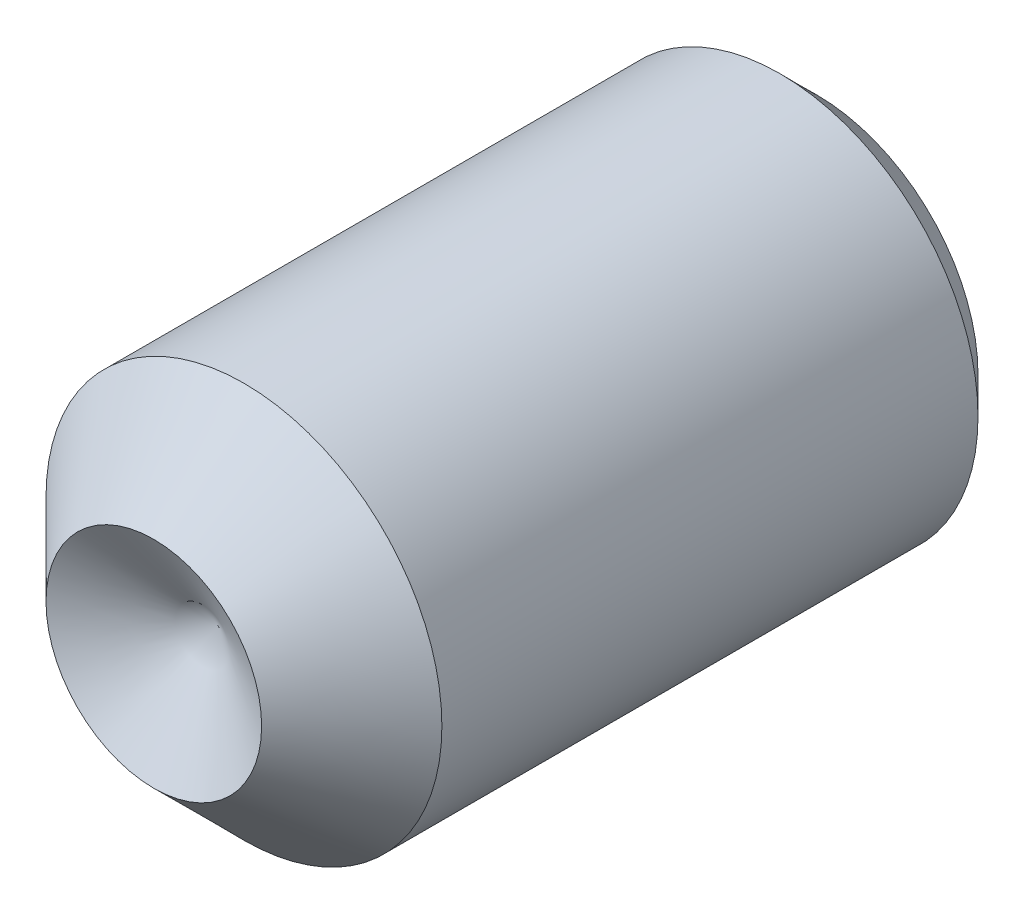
from build123d import *

# Parameters (mm, degrees)
SKETCH1_R     = 1.4224
SHANK_DEPTH   = 4.7625
HEX_2_DEPTH   = 1.27
CHAMFER1_SIZE = 0.262466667


with BuildPart() as part:
    # Sketch1 → Shank (new body)
    with BuildSketch(Plane.XY):
        with Locations(Location((0, 0, 0), (0, 0, 180))):
            Circle(SKETCH1_R)
    extrude(amount=SHANK_DEPTH)

    # Sketch3 → Cup and Chamfer (revolve, cut)
    with BuildSketch(Plane(origin=(0, 0, 0), x_dir=(1, 0, 0), z_dir=(0, 1, 0)), mode=Mode.PRIVATE) as cup_and_chamfer_sk:
        Polygon((0, -4.297013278), (0.7747, -4.7625), (1.4224, -4.1148), (1.4224, -5.879288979), (0, -5.879288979), align=None)
    revolve(cup_and_chamfer_sk.sketch.rotate(Axis((0, 0, -0.855169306), (0, 0, 1)), 180), axis=Axis((0, 0, -0.855169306), (0, 0, 1)), mode=Mode.SUBTRACT)

    # Sketch7 → Hex 2 (cut)
    with BuildSketch(Plane(origin=(-1.013776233, 4.128685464, 0), x_dir=(-1, 0, 0), z_dir=(0, 0, -1))):
        Polygon((-1.648776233, -4.495302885), (-1.648776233, -3.762068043), (-1.013776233, -3.395450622), (-0.378776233, -3.762068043), (-0.378776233, -4.495302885), (-1.013776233, -4.861920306), align=None)
    extrude(amount=-HEX_2_DEPTH, mode=Mode.SUBTRACT)

    # Chamfer1
    chamfer1_edges = [part.edges().sort_by_distance(p)[0] for p in [
        (1.4224, 0, 0),
    ]]
    chamfer(chamfer1_edges, length=CHAMFER1_SIZE)


solid = part.part
